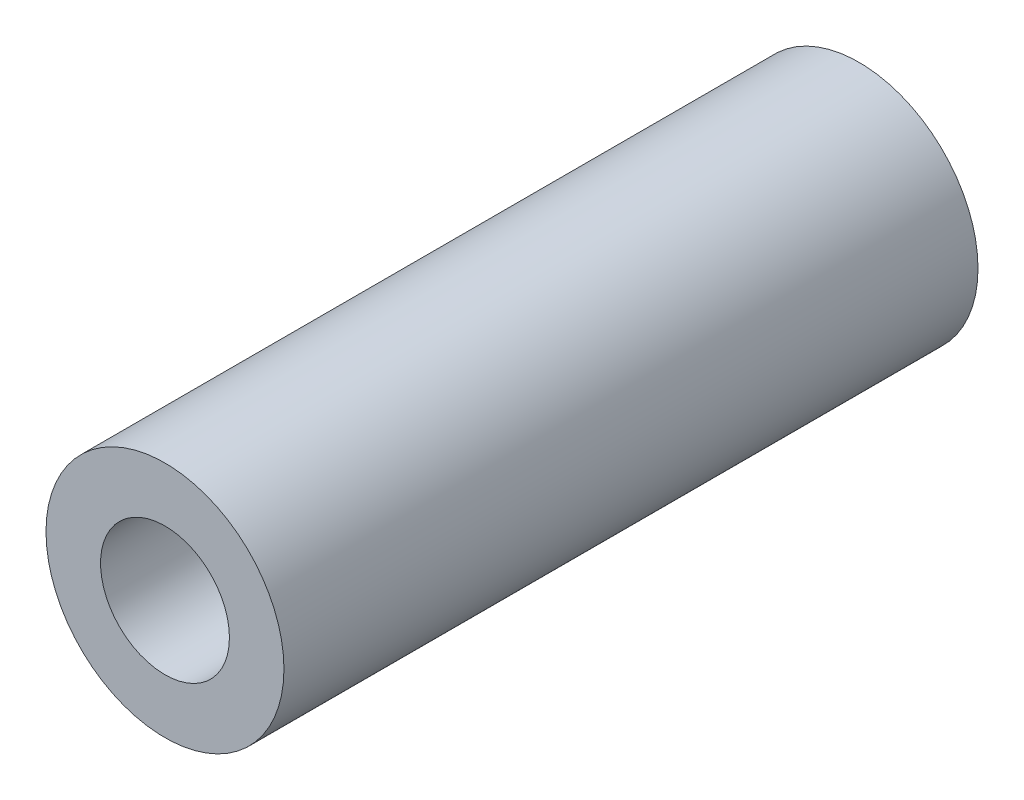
from build123d import *

# Parameters (mm, degrees)
ESQUISSE1_R          = 6
ESQUISSE1_R_2        = 3.25
BASE_EXTRUSION_DEPTH = 35


with BuildPart() as part:
    # Esquisse1 → Base-Extrusion (new body)
    with BuildSketch(Plane.XY):
        Circle(ESQUISSE1_R)
        Circle(ESQUISSE1_R_2, mode=Mode.SUBTRACT)
    extrude(amount=BASE_EXTRUSION_DEPTH)


solid = part.part
